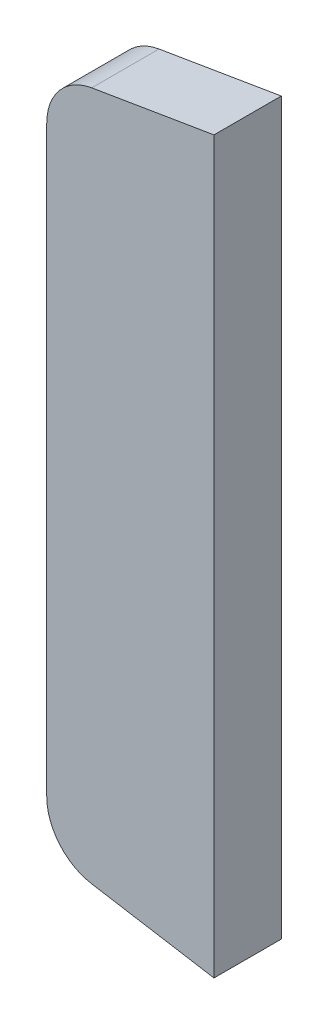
ISO-10303-21;
HEADER;
FILE_DESCRIPTION(('STEP AP214'),'2;1');
FILE_NAME('part.step','',(''),(''),'','','');
FILE_SCHEMA(('AUTOMOTIVE_DESIGN { 1 0 10303 214 1 1 1 1 }'));
ENDSEC;
DATA;
#1=APPLICATION_CONTEXT('core data for automotive mechanical design processes');
#2=APPLICATION_PROTOCOL_DEFINITION('international standard','automotive_design',2000,#1);
#3=PRODUCT_CONTEXT('',#1,'mechanical');
#4=PRODUCT('Part','Part','',(#3));
#5=PRODUCT_RELATED_PRODUCT_CATEGORY('part','',(#4));
#6=PRODUCT_DEFINITION_FORMATION('','',#4);
#7=PRODUCT_DEFINITION_CONTEXT('part definition',#1,'design');
#8=PRODUCT_DEFINITION('design','',#6,#7);
#9=PRODUCT_DEFINITION_SHAPE('','',#8);
#10=(LENGTH_UNIT() NAMED_UNIT(*) SI_UNIT(.MILLI.,.METRE.));
#11=(NAMED_UNIT(*) PLANE_ANGLE_UNIT() SI_UNIT($,.RADIAN.));
#12=(NAMED_UNIT(*) SI_UNIT($,.STERADIAN.) SOLID_ANGLE_UNIT());
#13=UNCERTAINTY_MEASURE_WITH_UNIT(LENGTH_MEASURE(1.E-05),#10,'distance_accuracy_value','');
#14=(GEOMETRIC_REPRESENTATION_CONTEXT(3) GLOBAL_UNCERTAINTY_ASSIGNED_CONTEXT((#13)) GLOBAL_UNIT_ASSIGNED_CONTEXT((#10,
#11,#12)) REPRESENTATION_CONTEXT('',''));
#15=CARTESIAN_POINT('',(0.,0.,0.));
#16=DIRECTION('',(0.,0.,1.));
#17=DIRECTION('',(1.,0.,0.));
#18=AXIS2_PLACEMENT_3D('',#15,#16,#17);
#19=CARTESIAN_POINT('',(0.,54.2496355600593,5.));
#20=DIRECTION('',(0.164410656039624,-0.986391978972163,0.));
#21=DIRECTION('',(0.986391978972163,0.164410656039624,0.));
#22=AXIS2_PLACEMENT_3D('',#19,#20,#21);
#23=PLANE('',#22);
#24=DIRECTION('',(-0.986391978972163,-0.164410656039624,0.));
#25=VECTOR('',#24,1.);
#26=CARTESIAN_POINT('',(0.,54.2496355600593,-5.));
#27=LINE('',#26,#25);
#28=CARTESIAN_POINT('',(0.,54.2496355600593,-5.));
#29=VERTEX_POINT('',#28);
#30=CARTESIAN_POINT('',(-18.1622890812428,51.2223665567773,-5.));
#31=VERTEX_POINT('',#30);
#32=EDGE_CURVE('E124',#29,#31,#27,.T.);
#33=ORIENTED_EDGE('',*,*,#32,.T.);
#34=DIRECTION('',(0.,0.,-1.));
#35=VECTOR('',#34,1.);
#36=CARTESIAN_POINT('',(-18.1622890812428,51.2223665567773,5.));
#37=LINE('',#36,#35);
#38=CARTESIAN_POINT('',(-18.1622890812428,51.2223665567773,5.));
#39=VERTEX_POINT('',#38);
#40=EDGE_CURVE('E11',#39,#31,#37,.T.);
#41=ORIENTED_EDGE('',*,*,#40,.F.);
#42=DIRECTION('',(-0.986391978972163,-0.164410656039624,0.));
#43=VECTOR('',#42,1.);
#44=CARTESIAN_POINT('',(0.,54.2496355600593,5.));
#45=LINE('',#44,#43);
#46=CARTESIAN_POINT('',(0.,54.2496355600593,5.));
#47=VERTEX_POINT('',#46);
#48=EDGE_CURVE('E134',#47,#39,#45,.T.);
#49=ORIENTED_EDGE('',*,*,#48,.F.);
#50=DIRECTION('',(0.,0.,-1.));
#51=VECTOR('',#50,1.);
#52=CARTESIAN_POINT('',(0.,54.2496355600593,5.));
#53=LINE('',#52,#51);
#54=EDGE_CURVE('E123',#47,#29,#53,.T.);
#55=ORIENTED_EDGE('',*,*,#54,.T.);
#56=EDGE_LOOP('',(#33,#41,#49,#55));
#57=FACE_BOUND('',#56,.T.);
#58=ADVANCED_FACE('F41',(#57),#23,.F.);
#59=CARTESIAN_POINT('',(-16.8470038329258,43.331230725,5.));
#60=DIRECTION('',(0.,0.,-1.));
#61=DIRECTION('',(-1.,0.,0.));
#62=AXIS2_PLACEMENT_3D('',#59,#60,#61);
#63=CYLINDRICAL_SURFACE('',#62,8.);
#64=CARTESIAN_POINT('',(-16.8470038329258,43.331230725,-5.));
#65=DIRECTION('',(0.,0.,1.));
#66=DIRECTION('',(1.,0.,0.));
#67=AXIS2_PLACEMENT_3D('',#64,#65,#66);
#68=CIRCLE('',#67,8.);
#69=CARTESIAN_POINT('',(-24.8470038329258,43.331230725,-5.));
#70=VERTEX_POINT('',#69);
#71=EDGE_CURVE('E126',#31,#70,#68,.T.);
#72=ORIENTED_EDGE('',*,*,#71,.T.);
#73=DIRECTION('',(0.,0.,-1.));
#74=VECTOR('',#73,1.);
#75=CARTESIAN_POINT('',(-24.8470038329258,43.331230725,5.));
#76=LINE('',#75,#74);
#77=CARTESIAN_POINT('',(-24.8470038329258,43.331230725,5.));
#78=VERTEX_POINT('',#77);
#79=EDGE_CURVE('E47',#78,#70,#76,.T.);
#80=ORIENTED_EDGE('',*,*,#79,.F.);
#81=CARTESIAN_POINT('',(-16.8470038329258,43.331230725,5.));
#82=DIRECTION('',(0.,0.,1.));
#83=DIRECTION('',(1.,0.,0.));
#84=AXIS2_PLACEMENT_3D('',#81,#82,#83);
#85=CIRCLE('',#84,8.);
#86=EDGE_CURVE('E92',#39,#78,#85,.T.);
#87=ORIENTED_EDGE('',*,*,#86,.F.);
#88=ORIENTED_EDGE('',*,*,#40,.T.);
#89=EDGE_LOOP('',(#72,#80,#87,#88));
#90=FACE_BOUND('',#89,.T.);
#91=ADVANCED_FACE('F159',(#90),#63,.T.);
#92=CARTESIAN_POINT('',(-24.8470038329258,43.331230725,5.));
#93=DIRECTION('',(1.,0.,0.));
#94=DIRECTION('',(0.,1.,0.));
#95=AXIS2_PLACEMENT_3D('',#92,#93,#94);
#96=PLANE('',#95);
#97=DIRECTION('',(0.,-1.,0.));
#98=VECTOR('',#97,1.);
#99=CARTESIAN_POINT('',(-24.8470038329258,43.331230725,-5.));
#100=LINE('',#99,#98);
#101=CARTESIAN_POINT('',(-24.8470038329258,-43.331230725,-5.));
#102=VERTEX_POINT('',#101);
#103=EDGE_CURVE('E127',#70,#102,#100,.T.);
#104=ORIENTED_EDGE('',*,*,#103,.T.);
#105=DIRECTION('',(0.,0.,-1.));
#106=VECTOR('',#105,1.);
#107=CARTESIAN_POINT('',(-24.8470038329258,-43.331230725,5.));
#108=LINE('',#107,#106);
#109=CARTESIAN_POINT('',(-24.8470038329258,-43.331230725,5.));
#110=VERTEX_POINT('',#109);
#111=EDGE_CURVE('E116',#110,#102,#108,.T.);
#112=ORIENTED_EDGE('',*,*,#111,.F.);
#113=DIRECTION('',(0.,-1.,0.));
#114=VECTOR('',#113,1.);
#115=CARTESIAN_POINT('',(-24.8470038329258,43.331230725,5.));
#116=LINE('',#115,#114);
#117=EDGE_CURVE('E109',#78,#110,#116,.T.);
#118=ORIENTED_EDGE('',*,*,#117,.F.);
#119=ORIENTED_EDGE('',*,*,#79,.T.);
#120=EDGE_LOOP('',(#104,#112,#118,#119));
#121=FACE_BOUND('',#120,.T.);
#122=ADVANCED_FACE('F141',(#121),#96,.F.);
#123=CARTESIAN_POINT('',(-16.8470038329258,-43.331230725,5.));
#124=DIRECTION('',(0.,0.,-1.));
#125=DIRECTION('',(-1.,0.,0.));
#126=AXIS2_PLACEMENT_3D('',#123,#124,#125);
#127=CYLINDRICAL_SURFACE('',#126,8.);
#128=CARTESIAN_POINT('',(-16.8470038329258,-43.331230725,-5.));
#129=DIRECTION('',(0.,0.,1.));
#130=DIRECTION('',(1.,0.,0.));
#131=AXIS2_PLACEMENT_3D('',#128,#129,#130);
#132=CIRCLE('',#131,8.);
#133=CARTESIAN_POINT('',(-18.1622890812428,-51.2223665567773,-5.));
#134=VERTEX_POINT('',#133);
#135=EDGE_CURVE('E113',#102,#134,#132,.T.);
#136=ORIENTED_EDGE('',*,*,#135,.T.);
#137=DIRECTION('',(0.,0.,-1.));
#138=VECTOR('',#137,1.);
#139=CARTESIAN_POINT('',(-18.1622890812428,-51.2223665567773,5.));
#140=LINE('',#139,#138);
#141=CARTESIAN_POINT('',(-18.1622890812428,-51.2223665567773,5.));
#142=VERTEX_POINT('',#141);
#143=EDGE_CURVE('E115',#142,#134,#140,.T.);
#144=ORIENTED_EDGE('',*,*,#143,.F.);
#145=CARTESIAN_POINT('',(-16.8470038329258,-43.331230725,5.));
#146=DIRECTION('',(0.,0.,1.));
#147=DIRECTION('',(1.,0.,0.));
#148=AXIS2_PLACEMENT_3D('',#145,#146,#147);
#149=CIRCLE('',#148,8.);
#150=EDGE_CURVE('E102',#110,#142,#149,.T.);
#151=ORIENTED_EDGE('',*,*,#150,.F.);
#152=ORIENTED_EDGE('',*,*,#111,.T.);
#153=EDGE_LOOP('',(#136,#144,#151,#152));
#154=FACE_BOUND('',#153,.T.);
#155=ADVANCED_FACE('F111',(#154),#127,.T.);
#156=CARTESIAN_POINT('',(-18.1622890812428,-51.2223665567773,5.));
#157=DIRECTION('',(0.164410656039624,0.986391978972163,0.));
#158=DIRECTION('',(-0.986391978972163,0.164410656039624,0.));
#159=AXIS2_PLACEMENT_3D('',#156,#157,#158);
#160=PLANE('',#159);
#161=DIRECTION('',(0.986391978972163,-0.164410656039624,0.));
#162=VECTOR('',#161,1.);
#163=CARTESIAN_POINT('',(-18.1622890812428,-51.2223665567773,-5.));
#164=LINE('',#163,#162);
#165=CARTESIAN_POINT('',(0.,-54.2496355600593,-5.));
#166=VERTEX_POINT('',#165);
#167=EDGE_CURVE('E79',#134,#166,#164,.T.);
#168=ORIENTED_EDGE('',*,*,#167,.T.);
#169=DIRECTION('',(0.,0.,-1.));
#170=VECTOR('',#169,1.);
#171=CARTESIAN_POINT('',(0.,-54.2496355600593,5.));
#172=LINE('',#171,#170);
#173=CARTESIAN_POINT('',(0.,-54.2496355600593,5.));
#174=VERTEX_POINT('',#173);
#175=EDGE_CURVE('E117',#174,#166,#172,.T.);
#176=ORIENTED_EDGE('',*,*,#175,.F.);
#177=DIRECTION('',(0.986391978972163,-0.164410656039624,0.));
#178=VECTOR('',#177,1.);
#179=CARTESIAN_POINT('',(-18.1622890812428,-51.2223665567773,5.));
#180=LINE('',#179,#178);
#181=EDGE_CURVE('E103',#142,#174,#180,.T.);
#182=ORIENTED_EDGE('',*,*,#181,.F.);
#183=ORIENTED_EDGE('',*,*,#143,.T.);
#184=EDGE_LOOP('',(#168,#176,#182,#183));
#185=FACE_BOUND('',#184,.T.);
#186=ADVANCED_FACE('F118',(#185),#160,.F.);
#187=CARTESIAN_POINT('',(0.,54.2496355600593,5.));
#188=DIRECTION('',(-1.,0.,0.));
#189=DIRECTION('',(0.,-1.,0.));
#190=AXIS2_PLACEMENT_3D('',#187,#188,#189);
#191=PLANE('',#190);
#192=DIRECTION('',(0.,1.,0.));
#193=VECTOR('',#192,1.);
#194=CARTESIAN_POINT('',(0.,54.2496355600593,-5.));
#195=LINE('',#194,#193);
#196=EDGE_CURVE('E86',#166,#29,#195,.T.);
#197=ORIENTED_EDGE('',*,*,#196,.T.);
#198=ORIENTED_EDGE('',*,*,#54,.F.);
#199=DIRECTION('',(0.,1.,0.));
#200=VECTOR('',#199,1.);
#201=CARTESIAN_POINT('',(0.,54.2496355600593,5.));
#202=LINE('',#201,#200);
#203=EDGE_CURVE('E60',#174,#47,#202,.T.);
#204=ORIENTED_EDGE('',*,*,#203,.F.);
#205=ORIENTED_EDGE('',*,*,#175,.T.);
#206=EDGE_LOOP('',(#197,#198,#204,#205));
#207=FACE_BOUND('',#206,.T.);
#208=ADVANCED_FACE('F149',(#207),#191,.F.);
#209=CARTESIAN_POINT('',(-16.8470038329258,43.331230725,5.));
#210=DIRECTION('',(0.,0.,1.));
#211=DIRECTION('',(1.,0.,0.));
#212=AXIS2_PLACEMENT_3D('',#209,#210,#211);
#213=PLANE('',#212);
#214=ORIENTED_EDGE('',*,*,#48,.T.);
#215=ORIENTED_EDGE('',*,*,#86,.T.);
#216=ORIENTED_EDGE('',*,*,#117,.T.);
#217=ORIENTED_EDGE('',*,*,#150,.T.);
#218=ORIENTED_EDGE('',*,*,#181,.T.);
#219=ORIENTED_EDGE('',*,*,#203,.T.);
#220=EDGE_LOOP('',(#214,#215,#216,#217,#218,#219));
#221=FACE_BOUND('',#220,.T.);
#222=ADVANCED_FACE('F104',(#221),#213,.T.);
#223=CARTESIAN_POINT('',(-16.8470038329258,43.331230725,-5.));
#224=DIRECTION('',(0.,0.,1.));
#225=DIRECTION('',(1.,0.,0.));
#226=AXIS2_PLACEMENT_3D('',#223,#224,#225);
#227=PLANE('',#226);
#228=ORIENTED_EDGE('',*,*,#32,.F.);
#229=ORIENTED_EDGE('',*,*,#196,.F.);
#230=ORIENTED_EDGE('',*,*,#167,.F.);
#231=ORIENTED_EDGE('',*,*,#135,.F.);
#232=ORIENTED_EDGE('',*,*,#103,.F.);
#233=ORIENTED_EDGE('',*,*,#71,.F.);
#234=EDGE_LOOP('',(#228,#229,#230,#231,#232,#233));
#235=FACE_BOUND('',#234,.T.);
#236=ADVANCED_FACE('F143',(#235),#227,.F.);
#237=CLOSED_SHELL('',(#58,#91,#122,#155,#186,#208,#222,#236));
#238=MANIFOLD_SOLID_BREP('B2',#237);
#239=ADVANCED_BREP_SHAPE_REPRESENTATION('',(#18,#238),#14);
#240=SHAPE_DEFINITION_REPRESENTATION(#9,#239);
ENDSEC;
END-ISO-10303-21;
